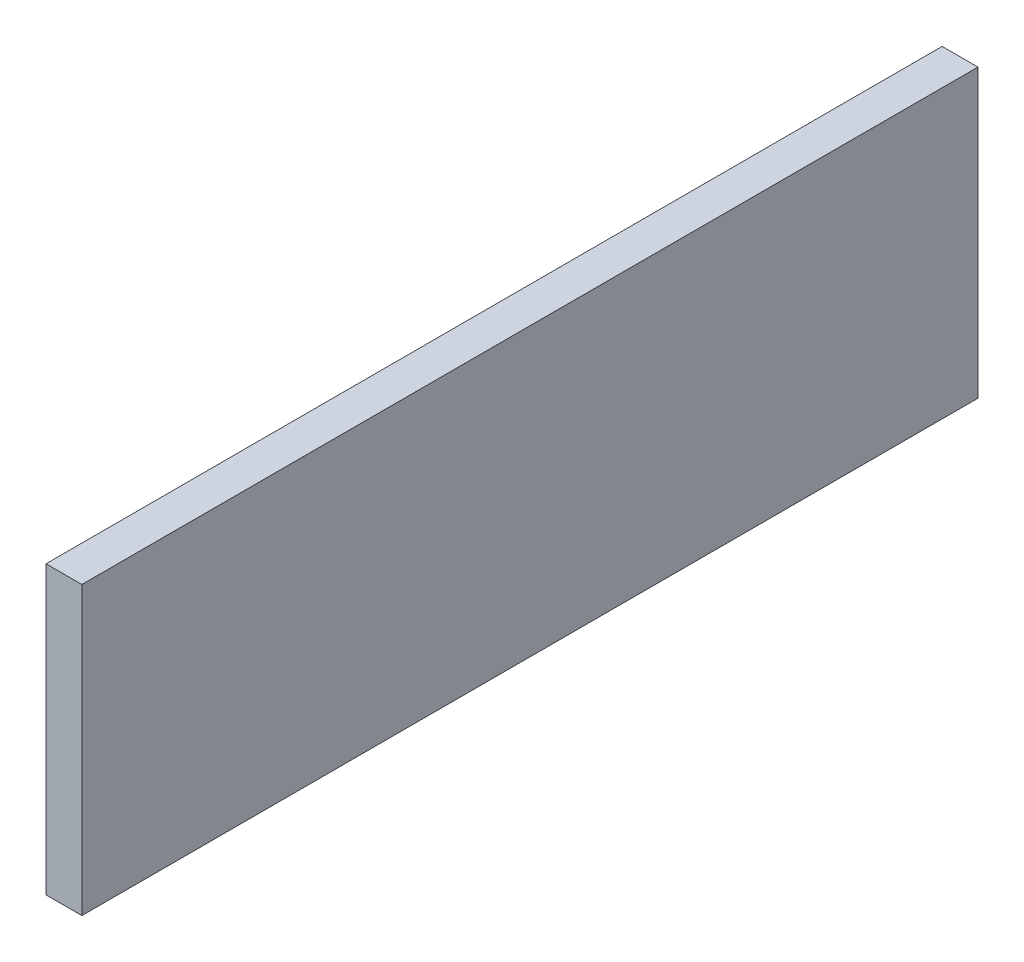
ISO-10303-21;
HEADER;
FILE_DESCRIPTION(('STEP AP214'),'2;1');
FILE_NAME('part.step','',(''),(''),'','','');
FILE_SCHEMA(('AUTOMOTIVE_DESIGN { 1 0 10303 214 1 1 1 1 }'));
ENDSEC;
DATA;
#1=APPLICATION_CONTEXT('core data for automotive mechanical design processes');
#2=APPLICATION_PROTOCOL_DEFINITION('international standard','automotive_design',2000,#1);
#3=PRODUCT_CONTEXT('',#1,'mechanical');
#4=PRODUCT('Part','Part','',(#3));
#5=PRODUCT_RELATED_PRODUCT_CATEGORY('part','',(#4));
#6=PRODUCT_DEFINITION_FORMATION('','',#4);
#7=PRODUCT_DEFINITION_CONTEXT('part definition',#1,'design');
#8=PRODUCT_DEFINITION('design','',#6,#7);
#9=PRODUCT_DEFINITION_SHAPE('','',#8);
#10=(LENGTH_UNIT() NAMED_UNIT(*) SI_UNIT(.MILLI.,.METRE.));
#11=(NAMED_UNIT(*) PLANE_ANGLE_UNIT() SI_UNIT($,.RADIAN.));
#12=(NAMED_UNIT(*) SI_UNIT($,.STERADIAN.) SOLID_ANGLE_UNIT());
#13=UNCERTAINTY_MEASURE_WITH_UNIT(LENGTH_MEASURE(1.E-05),#10,'distance_accuracy_value','');
#14=(GEOMETRIC_REPRESENTATION_CONTEXT(3) GLOBAL_UNCERTAINTY_ASSIGNED_CONTEXT((#13)) GLOBAL_UNIT_ASSIGNED_CONTEXT((#10,
#11,#12)) REPRESENTATION_CONTEXT('',''));
#15=CARTESIAN_POINT('',(0.,0.,0.));
#16=DIRECTION('',(0.,0.,1.));
#17=DIRECTION('',(1.,0.,0.));
#18=AXIS2_PLACEMENT_3D('',#15,#16,#17);
#19=CARTESIAN_POINT('',(0.,0.,250.));
#20=DIRECTION('',(1.,0.,0.));
#21=DIRECTION('',(0.,0.,-1.));
#22=AXIS2_PLACEMENT_3D('',#19,#20,#21);
#23=PLANE('',#22);
#24=DIRECTION('',(0.,-1.,0.));
#25=VECTOR('',#24,1.);
#26=CARTESIAN_POINT('',(0.,0.,0.));
#27=LINE('',#26,#25);
#28=CARTESIAN_POINT('',(0.,80.,0.));
#29=VERTEX_POINT('',#28);
#30=CARTESIAN_POINT('',(0.,0.,0.));
#31=VERTEX_POINT('',#30);
#32=EDGE_CURVE('E398',#29,#31,#27,.T.);
#33=ORIENTED_EDGE('',*,*,#32,.T.);
#34=DIRECTION('',(0.,0.,-1.));
#35=VECTOR('',#34,1.);
#36=CARTESIAN_POINT('',(0.,0.,250.));
#37=LINE('',#36,#35);
#38=CARTESIAN_POINT('',(0.,0.,250.));
#39=VERTEX_POINT('',#38);
#40=EDGE_CURVE('E11',#39,#31,#37,.T.);
#41=ORIENTED_EDGE('',*,*,#40,.F.);
#42=DIRECTION('',(0.,-1.,0.));
#43=VECTOR('',#42,1.);
#44=CARTESIAN_POINT('',(0.,0.,250.));
#45=LINE('',#44,#43);
#46=CARTESIAN_POINT('',(0.,80.,250.));
#47=VERTEX_POINT('',#46);
#48=EDGE_CURVE('E416',#47,#39,#45,.T.);
#49=ORIENTED_EDGE('',*,*,#48,.F.);
#50=DIRECTION('',(0.,0.,-1.));
#51=VECTOR('',#50,1.);
#52=CARTESIAN_POINT('',(0.,80.,250.));
#53=LINE('',#52,#51);
#54=EDGE_CURVE('E410',#47,#29,#53,.T.);
#55=ORIENTED_EDGE('',*,*,#54,.T.);
#56=EDGE_LOOP('',(#33,#41,#49,#55));
#57=FACE_BOUND('',#56,.T.);
#58=ADVANCED_FACE('F354',(#57),#23,.F.);
#59=CARTESIAN_POINT('',(0.,0.,250.));
#60=DIRECTION('',(0.,1.,0.));
#61=DIRECTION('',(0.,0.,1.));
#62=AXIS2_PLACEMENT_3D('',#59,#60,#61);
#63=PLANE('',#62);
#64=DIRECTION('',(1.,0.,0.));
#65=VECTOR('',#64,1.);
#66=CARTESIAN_POINT('',(0.,0.,0.));
#67=LINE('',#66,#65);
#68=CARTESIAN_POINT('',(10.,0.,0.));
#69=VERTEX_POINT('',#68);
#70=EDGE_CURVE('E394',#31,#69,#67,.T.);
#71=ORIENTED_EDGE('',*,*,#70,.T.);
#72=DIRECTION('',(0.,0.,-1.));
#73=VECTOR('',#72,1.);
#74=CARTESIAN_POINT('',(10.,0.,250.));
#75=LINE('',#74,#73);
#76=CARTESIAN_POINT('',(10.,0.,250.));
#77=VERTEX_POINT('',#76);
#78=EDGE_CURVE('E361',#77,#69,#75,.T.);
#79=ORIENTED_EDGE('',*,*,#78,.F.);
#80=DIRECTION('',(1.,0.,0.));
#81=VECTOR('',#80,1.);
#82=CARTESIAN_POINT('',(0.,0.,250.));
#83=LINE('',#82,#81);
#84=EDGE_CURVE('E406',#39,#77,#83,.T.);
#85=ORIENTED_EDGE('',*,*,#84,.F.);
#86=ORIENTED_EDGE('',*,*,#40,.T.);
#87=EDGE_LOOP('',(#71,#79,#85,#86));
#88=FACE_BOUND('',#87,.T.);
#89=ADVANCED_FACE('F405',(#88),#63,.F.);
#90=CARTESIAN_POINT('',(10.,0.,250.));
#91=DIRECTION('',(-1.,0.,0.));
#92=DIRECTION('',(0.,0.,1.));
#93=AXIS2_PLACEMENT_3D('',#90,#91,#92);
#94=PLANE('',#93);
#95=DIRECTION('',(0.,1.,0.));
#96=VECTOR('',#95,1.);
#97=CARTESIAN_POINT('',(10.,0.,0.));
#98=LINE('',#97,#96);
#99=CARTESIAN_POINT('',(10.,80.,0.));
#100=VERTEX_POINT('',#99);
#101=EDGE_CURVE('E399',#69,#100,#98,.T.);
#102=ORIENTED_EDGE('',*,*,#101,.T.);
#103=DIRECTION('',(0.,0.,-1.));
#104=VECTOR('',#103,1.);
#105=CARTESIAN_POINT('',(10.,80.,250.));
#106=LINE('',#105,#104);
#107=CARTESIAN_POINT('',(10.,80.,250.));
#108=VERTEX_POINT('',#107);
#109=EDGE_CURVE('E422',#108,#100,#106,.T.);
#110=ORIENTED_EDGE('',*,*,#109,.F.);
#111=DIRECTION('',(0.,1.,0.));
#112=VECTOR('',#111,1.);
#113=CARTESIAN_POINT('',(10.,0.,250.));
#114=LINE('',#113,#112);
#115=EDGE_CURVE('E373',#77,#108,#114,.T.);
#116=ORIENTED_EDGE('',*,*,#115,.F.);
#117=ORIENTED_EDGE('',*,*,#78,.T.);
#118=EDGE_LOOP('',(#102,#110,#116,#117));
#119=FACE_BOUND('',#118,.T.);
#120=ADVANCED_FACE('F425',(#119),#94,.F.);
#121=CARTESIAN_POINT('',(0.,80.,250.));
#122=DIRECTION('',(0.,-1.,0.));
#123=DIRECTION('',(0.,0.,-1.));
#124=AXIS2_PLACEMENT_3D('',#121,#122,#123);
#125=PLANE('',#124);
#126=DIRECTION('',(-1.,0.,0.));
#127=VECTOR('',#126,1.);
#128=CARTESIAN_POINT('',(0.,80.,0.));
#129=LINE('',#128,#127);
#130=EDGE_CURVE('E414',#100,#29,#129,.T.);
#131=ORIENTED_EDGE('',*,*,#130,.T.);
#132=ORIENTED_EDGE('',*,*,#54,.F.);
#133=DIRECTION('',(-1.,0.,0.));
#134=VECTOR('',#133,1.);
#135=CARTESIAN_POINT('',(0.,80.,250.));
#136=LINE('',#135,#134);
#137=EDGE_CURVE('E368',#108,#47,#136,.T.);
#138=ORIENTED_EDGE('',*,*,#137,.F.);
#139=ORIENTED_EDGE('',*,*,#109,.T.);
#140=EDGE_LOOP('',(#131,#132,#138,#139));
#141=FACE_BOUND('',#140,.T.);
#142=ADVANCED_FACE('F427',(#141),#125,.F.);
#143=CARTESIAN_POINT('',(0.,80.,250.));
#144=DIRECTION('',(0.,0.,-1.));
#145=DIRECTION('',(-1.,0.,0.));
#146=AXIS2_PLACEMENT_3D('',#143,#144,#145);
#147=PLANE('',#146);
#148=ORIENTED_EDGE('',*,*,#48,.T.);
#149=ORIENTED_EDGE('',*,*,#84,.T.);
#150=ORIENTED_EDGE('',*,*,#115,.T.);
#151=ORIENTED_EDGE('',*,*,#137,.T.);
#152=EDGE_LOOP('',(#148,#149,#150,#151));
#153=FACE_BOUND('',#152,.T.);
#154=ADVANCED_FACE('F428',(#153),#147,.F.);
#155=CARTESIAN_POINT('',(0.,80.,0.));
#156=DIRECTION('',(0.,0.,-1.));
#157=DIRECTION('',(-1.,0.,0.));
#158=AXIS2_PLACEMENT_3D('',#155,#156,#157);
#159=PLANE('',#158);
#160=ORIENTED_EDGE('',*,*,#32,.F.);
#161=ORIENTED_EDGE('',*,*,#130,.F.);
#162=ORIENTED_EDGE('',*,*,#101,.F.);
#163=ORIENTED_EDGE('',*,*,#70,.F.);
#164=EDGE_LOOP('',(#160,#161,#162,#163));
#165=FACE_BOUND('',#164,.T.);
#166=ADVANCED_FACE('F395',(#165),#159,.T.);
#167=CLOSED_SHELL('',(#58,#89,#120,#142,#154,#166));
#168=MANIFOLD_SOLID_BREP('B2',#167);
#169=ADVANCED_BREP_SHAPE_REPRESENTATION('',(#18,#168),#14);
#170=SHAPE_DEFINITION_REPRESENTATION(#9,#169);
ENDSEC;
END-ISO-10303-21;
